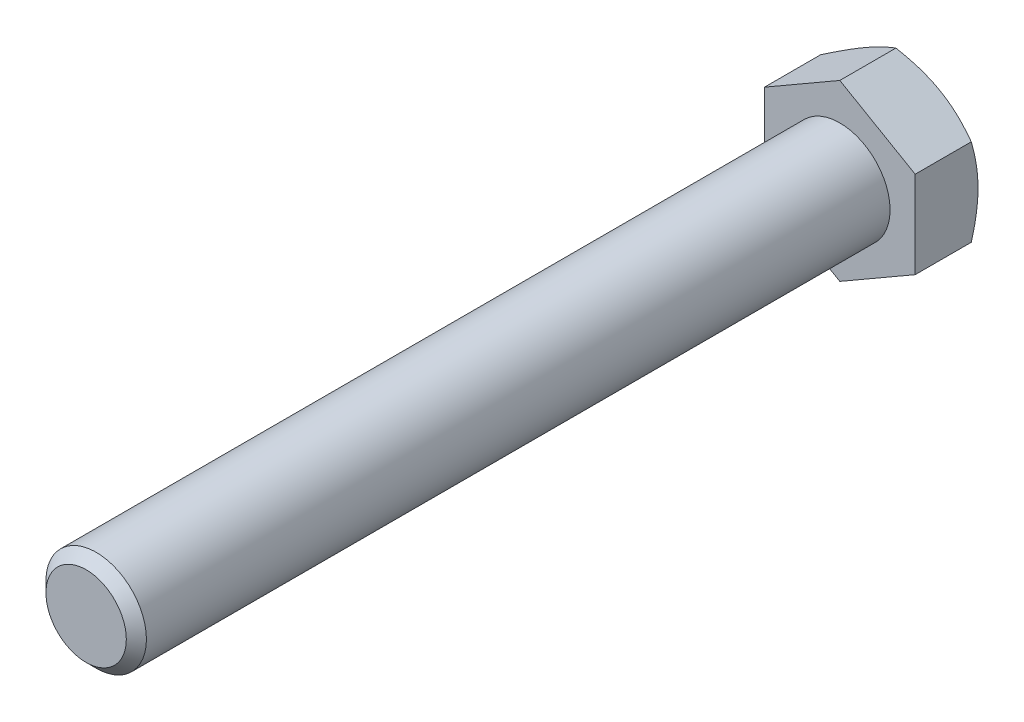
from build123d import *

# Parameters (mm, degrees)
ESQUISSE1_W        = 6
ESQUISSE1_H        = 90
CHANFREIN1_SIZE    = 1.2
BOSS_EXTRU_1_DEPTH = 7.5


with BuildPart() as part:
    # Esquisse1 → Base-R_volution (revolve)
    with BuildSketch(Plane(origin=(0, 0, 0), x_dir=(1, 0, 0), z_dir=(0, 1, 0))):
        with Locations((3, -45)):
            Rectangle(ESQUISSE1_W, ESQUISSE1_H)
    revolve(axis=Axis((0, 0, 0), (0, 0, 1)))

    # Chanfrein1
    chanfrein1_edges = [part.edges().sort_by_distance(p)[0] for p in [
        (-6, 0, 90),
    ]]
    chamfer(chanfrein1_edges, length=CHANFREIN1_SIZE)

    # Esquisse6 → Boss.-Extru.1 (add)
    with BuildSketch(Plane.XY):
        Polygon((9, -5.196152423), (9, 5.196152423), (0, 10.392304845), (-9, 5.196152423), (-9, -5.196152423), (0, -10.392304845), align=None)
    extrude(amount=-BOSS_EXTRU_1_DEPTH)

    # Esquisse7 → Enl_vement de mati_re-R_volution1 (revolve, cut)
    with BuildSketch(Plane(origin=(0, 0, 0), x_dir=(1, 0, 0), z_dir=(0, 1, 0))):
        Polygon((-9, 7.5), (-21.990381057, 7.5), (-21.990381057, 0), align=None)
    revolve(axis=Axis((0, 0, -6.239446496), (0, 0, 1)), mode=Mode.SUBTRACT)


solid = part.part
